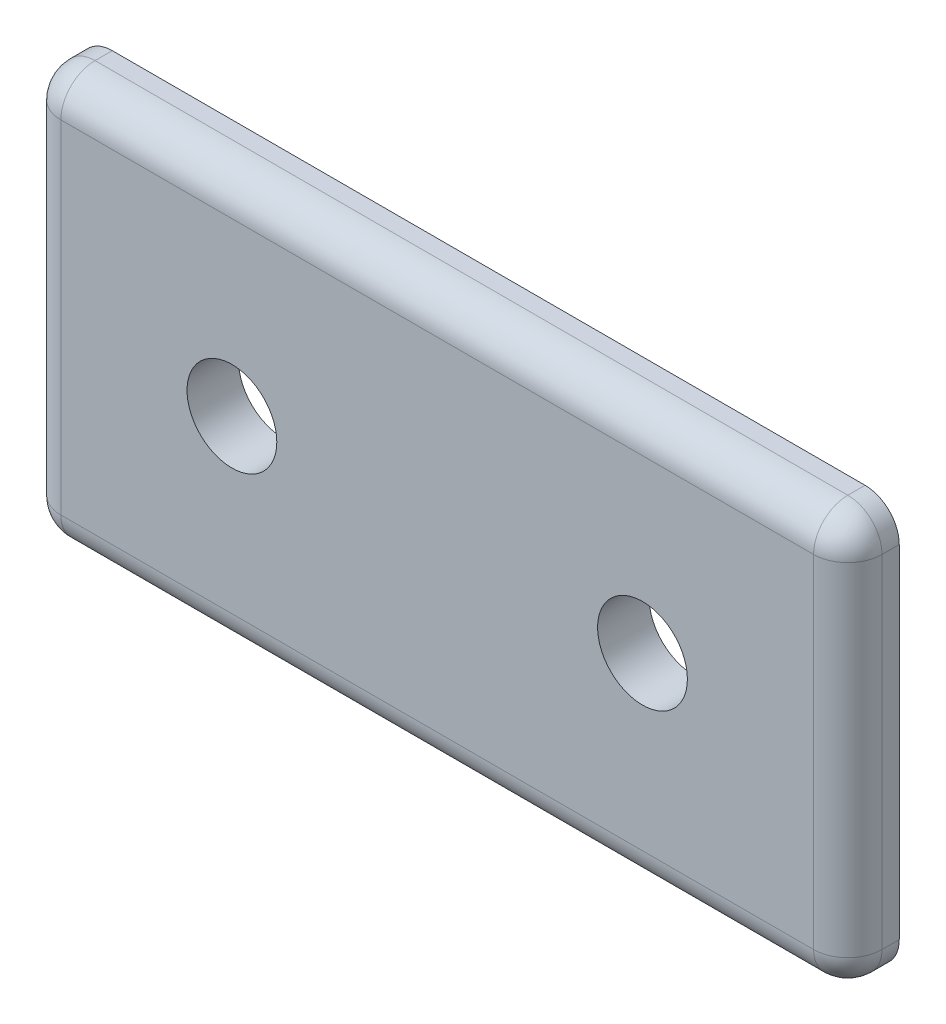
ISO-10303-21;
HEADER;
FILE_DESCRIPTION(('STEP AP214'),'2;1');
FILE_NAME('part.step','',(''),(''),'','','');
FILE_SCHEMA(('AUTOMOTIVE_DESIGN { 1 0 10303 214 1 1 1 1 }'));
ENDSEC;
DATA;
#1=APPLICATION_CONTEXT('core data for automotive mechanical design processes');
#2=APPLICATION_PROTOCOL_DEFINITION('international standard','automotive_design',2000,#1);
#3=PRODUCT_CONTEXT('',#1,'mechanical');
#4=PRODUCT('Part','Part','',(#3));
#5=PRODUCT_RELATED_PRODUCT_CATEGORY('part','',(#4));
#6=PRODUCT_DEFINITION_FORMATION('','',#4);
#7=PRODUCT_DEFINITION_CONTEXT('part definition',#1,'design');
#8=PRODUCT_DEFINITION('design','',#6,#7);
#9=PRODUCT_DEFINITION_SHAPE('','',#8);
#10=(LENGTH_UNIT() NAMED_UNIT(*) SI_UNIT(.MILLI.,.METRE.));
#11=(NAMED_UNIT(*) PLANE_ANGLE_UNIT() SI_UNIT($,.RADIAN.));
#12=(NAMED_UNIT(*) SI_UNIT($,.STERADIAN.) SOLID_ANGLE_UNIT());
#13=UNCERTAINTY_MEASURE_WITH_UNIT(LENGTH_MEASURE(1.E-05),#10,'distance_accuracy_value','');
#14=(GEOMETRIC_REPRESENTATION_CONTEXT(3) GLOBAL_UNCERTAINTY_ASSIGNED_CONTEXT((#13)) GLOBAL_UNIT_ASSIGNED_CONTEXT((#10,
#11,#12)) REPRESENTATION_CONTEXT('',''));
#15=CARTESIAN_POINT('',(0.,0.,0.));
#16=DIRECTION('',(0.,0.,1.));
#17=DIRECTION('',(1.,0.,0.));
#18=AXIS2_PLACEMENT_3D('',#15,#16,#17);
#19=CARTESIAN_POINT('',(-38.1,19.05,4.7752));
#20=DIRECTION('',(1.,0.,0.));
#21=DIRECTION('',(0.,0.,-1.));
#22=AXIS2_PLACEMENT_3D('',#19,#20,#21);
#23=PLANE('',#22);
#24=DIRECTION('',(0.,-1.,0.));
#25=VECTOR('',#24,1.);
#26=CARTESIAN_POINT('',(-38.1,19.05,0.));
#27=LINE('',#26,#25);
#28=CARTESIAN_POINT('',(-38.1,15.875,0.));
#29=VERTEX_POINT('',#28);
#30=CARTESIAN_POINT('',(-38.1,-15.875,0.));
#31=VERTEX_POINT('',#30);
#32=EDGE_CURVE('E198',#29,#31,#27,.T.);
#33=ORIENTED_EDGE('',*,*,#32,.T.);
#34=DIRECTION('',(0.,0.,-1.));
#35=VECTOR('',#34,1.);
#36=CARTESIAN_POINT('',(-38.1,-15.875,4.7752));
#37=LINE('',#36,#35);
#38=CARTESIAN_POINT('',(-38.1,-15.875,1.6002));
#39=VERTEX_POINT('',#38);
#40=EDGE_CURVE('E49',#31,#39,#37,.F.);
#41=ORIENTED_EDGE('',*,*,#40,.T.);
#42=DIRECTION('',(0.,-1.,0.));
#43=VECTOR('',#42,1.);
#44=CARTESIAN_POINT('',(-38.1,19.05,1.6002));
#45=LINE('',#44,#43);
#46=CARTESIAN_POINT('',(-38.1,15.875,1.6002));
#47=VERTEX_POINT('',#46);
#48=EDGE_CURVE('E54',#39,#47,#45,.F.);
#49=ORIENTED_EDGE('',*,*,#48,.T.);
#50=DIRECTION('',(0.,0.,-1.));
#51=VECTOR('',#50,1.);
#52=CARTESIAN_POINT('',(-38.1,15.875,4.7752));
#53=LINE('',#52,#51);
#54=EDGE_CURVE('E167',#47,#29,#53,.T.);
#55=ORIENTED_EDGE('',*,*,#54,.T.);
#56=EDGE_LOOP('',(#33,#41,#49,#55));
#57=FACE_BOUND('',#56,.T.);
#58=ADVANCED_FACE('F32',(#57),#23,.F.);
#59=CARTESIAN_POINT('',(-38.1,-19.05,4.7752));
#60=DIRECTION('',(0.,1.,0.));
#61=DIRECTION('',(0.,0.,1.));
#62=AXIS2_PLACEMENT_3D('',#59,#60,#61);
#63=PLANE('',#62);
#64=DIRECTION('',(1.,0.,0.));
#65=VECTOR('',#64,1.);
#66=CARTESIAN_POINT('',(-38.1,-19.05,1.6002));
#67=LINE('',#66,#65);
#68=CARTESIAN_POINT('',(34.925,-19.05,1.6002));
#69=VERTEX_POINT('',#68);
#70=CARTESIAN_POINT('',(-34.925,-19.05,1.6002));
#71=VERTEX_POINT('',#70);
#72=EDGE_CURVE('E163',#69,#71,#67,.F.);
#73=ORIENTED_EDGE('',*,*,#72,.T.);
#74=DIRECTION('',(0.,0.,-1.));
#75=VECTOR('',#74,1.);
#76=CARTESIAN_POINT('',(-34.925,-19.05,4.7752));
#77=LINE('',#76,#75);
#78=CARTESIAN_POINT('',(-34.925,-19.05,0.));
#79=VERTEX_POINT('',#78);
#80=EDGE_CURVE('E165',#71,#79,#77,.T.);
#81=ORIENTED_EDGE('',*,*,#80,.T.);
#82=DIRECTION('',(1.,0.,0.));
#83=VECTOR('',#82,1.);
#84=CARTESIAN_POINT('',(-38.1,-19.05,0.));
#85=LINE('',#84,#83);
#86=CARTESIAN_POINT('',(34.925,-19.05,0.));
#87=VERTEX_POINT('',#86);
#88=EDGE_CURVE('E200',#79,#87,#85,.T.);
#89=ORIENTED_EDGE('',*,*,#88,.T.);
#90=DIRECTION('',(0.,0.,-1.));
#91=VECTOR('',#90,1.);
#92=CARTESIAN_POINT('',(34.925,-19.05,4.7752));
#93=LINE('',#92,#91);
#94=EDGE_CURVE('E161',#87,#69,#93,.F.);
#95=ORIENTED_EDGE('',*,*,#94,.T.);
#96=EDGE_LOOP('',(#73,#81,#89,#95));
#97=FACE_BOUND('',#96,.T.);
#98=ADVANCED_FACE('F254',(#97),#63,.F.);
#99=CARTESIAN_POINT('',(38.1,19.05,4.7752));
#100=DIRECTION('',(-1.,0.,0.));
#101=DIRECTION('',(0.,0.,1.));
#102=AXIS2_PLACEMENT_3D('',#99,#100,#101);
#103=PLANE('',#102);
#104=DIRECTION('',(0.,1.,0.));
#105=VECTOR('',#104,1.);
#106=CARTESIAN_POINT('',(38.1,-19.05,1.6002));
#107=LINE('',#106,#105);
#108=CARTESIAN_POINT('',(38.1,15.875,1.6002));
#109=VERTEX_POINT('',#108);
#110=CARTESIAN_POINT('',(38.1,-15.875,1.6002));
#111=VERTEX_POINT('',#110);
#112=EDGE_CURVE('E157',#109,#111,#107,.F.);
#113=ORIENTED_EDGE('',*,*,#112,.T.);
#114=DIRECTION('',(0.,0.,-1.));
#115=VECTOR('',#114,1.);
#116=CARTESIAN_POINT('',(38.1,-15.875,4.7752));
#117=LINE('',#116,#115);
#118=CARTESIAN_POINT('',(38.1,-15.875,0.));
#119=VERTEX_POINT('',#118);
#120=EDGE_CURVE('E159',#111,#119,#117,.T.);
#121=ORIENTED_EDGE('',*,*,#120,.T.);
#122=DIRECTION('',(0.,1.,0.));
#123=VECTOR('',#122,1.);
#124=CARTESIAN_POINT('',(38.1,19.05,0.));
#125=LINE('',#124,#123);
#126=CARTESIAN_POINT('',(38.1,15.875,0.));
#127=VERTEX_POINT('',#126);
#128=EDGE_CURVE('E204',#119,#127,#125,.T.);
#129=ORIENTED_EDGE('',*,*,#128,.T.);
#130=DIRECTION('',(0.,0.,-1.));
#131=VECTOR('',#130,1.);
#132=CARTESIAN_POINT('',(38.1,15.875,4.7752));
#133=LINE('',#132,#131);
#134=EDGE_CURVE('E155',#127,#109,#133,.F.);
#135=ORIENTED_EDGE('',*,*,#134,.T.);
#136=EDGE_LOOP('',(#113,#121,#129,#135));
#137=FACE_BOUND('',#136,.T.);
#138=ADVANCED_FACE('F259',(#137),#103,.F.);
#139=CARTESIAN_POINT('',(-38.1,19.05,4.7752));
#140=DIRECTION('',(0.,-1.,0.));
#141=DIRECTION('',(0.,0.,-1.));
#142=AXIS2_PLACEMENT_3D('',#139,#140,#141);
#143=PLANE('',#142);
#144=DIRECTION('',(-1.,0.,0.));
#145=VECTOR('',#144,1.);
#146=CARTESIAN_POINT('',(38.1,19.05,1.6002));
#147=LINE('',#146,#145);
#148=CARTESIAN_POINT('',(-34.925,19.05,1.6002));
#149=VERTEX_POINT('',#148);
#150=CARTESIAN_POINT('',(34.925,19.05,1.6002));
#151=VERTEX_POINT('',#150);
#152=EDGE_CURVE('E117',#149,#151,#147,.F.);
#153=ORIENTED_EDGE('',*,*,#152,.T.);
#154=DIRECTION('',(0.,0.,-1.));
#155=VECTOR('',#154,1.);
#156=CARTESIAN_POINT('',(34.925,19.05,4.7752));
#157=LINE('',#156,#155);
#158=CARTESIAN_POINT('',(34.925,19.05,0.));
#159=VERTEX_POINT('',#158);
#160=EDGE_CURVE('E153',#151,#159,#157,.T.);
#161=ORIENTED_EDGE('',*,*,#160,.T.);
#162=DIRECTION('',(-1.,0.,0.));
#163=VECTOR('',#162,1.);
#164=CARTESIAN_POINT('',(-38.1,19.05,0.));
#165=LINE('',#164,#163);
#166=CARTESIAN_POINT('',(-34.925,19.05,0.));
#167=VERTEX_POINT('',#166);
#168=EDGE_CURVE('E140',#159,#167,#165,.T.);
#169=ORIENTED_EDGE('',*,*,#168,.T.);
#170=DIRECTION('',(0.,0.,-1.));
#171=VECTOR('',#170,1.);
#172=CARTESIAN_POINT('',(-34.925,19.05,4.7752));
#173=LINE('',#172,#171);
#174=EDGE_CURVE('E146',#167,#149,#173,.F.);
#175=ORIENTED_EDGE('',*,*,#174,.T.);
#176=EDGE_LOOP('',(#153,#161,#169,#175));
#177=FACE_BOUND('',#176,.T.);
#178=ADVANCED_FACE('F231',(#177),#143,.F.);
#179=CARTESIAN_POINT('',(-38.1,-19.05,4.7752));
#180=DIRECTION('',(0.,0.,1.));
#181=DIRECTION('',(1.,0.,0.));
#182=AXIS2_PLACEMENT_3D('',#179,#180,#181);
#183=PLANE('',#182);
#184=CARTESIAN_POINT('',(-19.05,0.,4.7752));
#185=DIRECTION('',(0.,0.,1.));
#186=DIRECTION('',(1.,0.,0.));
#187=AXIS2_PLACEMENT_3D('',#184,#185,#186);
#188=CIRCLE('',#187,4.1656);
#189=CARTESIAN_POINT('',(-14.8844,0.,4.7752));
#190=VERTEX_POINT('',#189);
#191=EDGE_CURVE('E421',#190,#190,#188,.T.);
#192=ORIENTED_EDGE('',*,*,#191,.F.);
#193=EDGE_LOOP('',(#192));
#194=FACE_BOUND('',#193,.T.);
#195=CARTESIAN_POINT('',(19.05,0.,4.7752));
#196=DIRECTION('',(0.,0.,1.));
#197=DIRECTION('',(1.,0.,0.));
#198=AXIS2_PLACEMENT_3D('',#195,#196,#197);
#199=CIRCLE('',#198,4.1656);
#200=CARTESIAN_POINT('',(23.2156,0.,4.7752));
#201=VERTEX_POINT('',#200);
#202=EDGE_CURVE('E424',#201,#201,#199,.T.);
#203=ORIENTED_EDGE('',*,*,#202,.F.);
#204=EDGE_LOOP('',(#203));
#205=FACE_BOUND('',#204,.T.);
#206=DIRECTION('',(0.,1.,0.));
#207=VECTOR('',#206,1.);
#208=CARTESIAN_POINT('',(34.925,19.05,4.7752));
#209=LINE('',#208,#207);
#210=CARTESIAN_POINT('',(34.925,-15.875,4.7752));
#211=VERTEX_POINT('',#210);
#212=CARTESIAN_POINT('',(34.925,15.875,4.7752));
#213=VERTEX_POINT('',#212);
#214=EDGE_CURVE('E144',#211,#213,#209,.T.);
#215=ORIENTED_EDGE('',*,*,#214,.T.);
#216=DIRECTION('',(-1.,0.,0.));
#217=VECTOR('',#216,1.);
#218=CARTESIAN_POINT('',(-38.1,15.875,4.7752));
#219=LINE('',#218,#217);
#220=CARTESIAN_POINT('',(-34.925,15.875,4.7752));
#221=VERTEX_POINT('',#220);
#222=EDGE_CURVE('E115',#213,#221,#219,.T.);
#223=ORIENTED_EDGE('',*,*,#222,.T.);
#224=DIRECTION('',(0.,-1.,0.));
#225=VECTOR('',#224,1.);
#226=CARTESIAN_POINT('',(-34.925,-19.05,4.7752));
#227=LINE('',#226,#225);
#228=CARTESIAN_POINT('',(-34.925,-15.875,4.7752));
#229=VERTEX_POINT('',#228);
#230=EDGE_CURVE('E133',#221,#229,#227,.T.);
#231=ORIENTED_EDGE('',*,*,#230,.T.);
#232=DIRECTION('',(1.,0.,0.));
#233=VECTOR('',#232,1.);
#234=CARTESIAN_POINT('',(38.1,-15.875,4.7752));
#235=LINE('',#234,#233);
#236=EDGE_CURVE('E139',#229,#211,#235,.T.);
#237=ORIENTED_EDGE('',*,*,#236,.T.);
#238=EDGE_LOOP('',(#215,#223,#231,#237));
#239=FACE_BOUND('',#238,.T.);
#240=ADVANCED_FACE('F142',(#194,#205,#239),#183,.T.);
#241=CARTESIAN_POINT('',(-38.1,-19.05,0.));
#242=DIRECTION('',(0.,0.,1.));
#243=DIRECTION('',(1.,0.,0.));
#244=AXIS2_PLACEMENT_3D('',#241,#242,#243);
#245=PLANE('',#244);
#246=CARTESIAN_POINT('',(-19.05,0.,0.));
#247=DIRECTION('',(0.,0.,1.));
#248=DIRECTION('',(1.,0.,0.));
#249=AXIS2_PLACEMENT_3D('',#246,#247,#248);
#250=CIRCLE('',#249,4.1656);
#251=CARTESIAN_POINT('',(-14.8844,0.,0.));
#252=VERTEX_POINT('',#251);
#253=EDGE_CURVE('E425',#252,#252,#250,.F.);
#254=ORIENTED_EDGE('',*,*,#253,.F.);
#255=EDGE_LOOP('',(#254));
#256=FACE_BOUND('',#255,.T.);
#257=CARTESIAN_POINT('',(19.05,0.,0.));
#258=DIRECTION('',(0.,0.,1.));
#259=DIRECTION('',(1.,0.,0.));
#260=AXIS2_PLACEMENT_3D('',#257,#258,#259);
#261=CIRCLE('',#260,4.1656);
#262=CARTESIAN_POINT('',(23.2156,0.,0.));
#263=VERTEX_POINT('',#262);
#264=EDGE_CURVE('E121',#263,#263,#261,.F.);
#265=ORIENTED_EDGE('',*,*,#264,.F.);
#266=EDGE_LOOP('',(#265));
#267=FACE_BOUND('',#266,.T.);
#268=ORIENTED_EDGE('',*,*,#88,.F.);
#269=CARTESIAN_POINT('',(-34.925,-15.875,0.));
#270=DIRECTION('',(0.,0.,1.));
#271=DIRECTION('',(1.,0.,0.));
#272=AXIS2_PLACEMENT_3D('',#269,#270,#271);
#273=CIRCLE('',#272,3.175);
#274=EDGE_CURVE('E11',#79,#31,#273,.F.);
#275=ORIENTED_EDGE('',*,*,#274,.T.);
#276=ORIENTED_EDGE('',*,*,#32,.F.);
#277=CARTESIAN_POINT('',(-34.925,15.875,0.));
#278=DIRECTION('',(0.,0.,1.));
#279=DIRECTION('',(1.,0.,0.));
#280=AXIS2_PLACEMENT_3D('',#277,#278,#279);
#281=CIRCLE('',#280,3.175);
#282=EDGE_CURVE('E171',#29,#167,#281,.F.);
#283=ORIENTED_EDGE('',*,*,#282,.T.);
#284=ORIENTED_EDGE('',*,*,#168,.F.);
#285=CARTESIAN_POINT('',(34.925,15.875,0.));
#286=DIRECTION('',(0.,0.,1.));
#287=DIRECTION('',(1.,0.,0.));
#288=AXIS2_PLACEMENT_3D('',#285,#286,#287);
#289=CIRCLE('',#288,3.175);
#290=EDGE_CURVE('E173',#159,#127,#289,.F.);
#291=ORIENTED_EDGE('',*,*,#290,.T.);
#292=ORIENTED_EDGE('',*,*,#128,.F.);
#293=CARTESIAN_POINT('',(34.925,-15.875,0.));
#294=DIRECTION('',(0.,0.,1.));
#295=DIRECTION('',(1.,0.,0.));
#296=AXIS2_PLACEMENT_3D('',#293,#294,#295);
#297=CIRCLE('',#296,3.175);
#298=EDGE_CURVE('E41',#119,#87,#297,.F.);
#299=ORIENTED_EDGE('',*,*,#298,.T.);
#300=EDGE_LOOP('',(#268,#275,#276,#283,#284,#291,#292,#299));
#301=FACE_BOUND('',#300,.T.);
#302=ADVANCED_FACE('F238',(#256,#267,#301),#245,.F.);
#303=CARTESIAN_POINT('',(34.925,-15.875,4.7752));
#304=DIRECTION('',(0.,0.,-1.));
#305=DIRECTION('',(-1.,0.,0.));
#306=AXIS2_PLACEMENT_3D('',#303,#304,#305);
#307=CYLINDRICAL_SURFACE('',#306,3.175);
#308=ORIENTED_EDGE('',*,*,#298,.F.);
#309=ORIENTED_EDGE('',*,*,#120,.F.);
#310=CARTESIAN_POINT('',(34.925,-15.875,1.6002));
#311=DIRECTION('',(0.,0.,1.));
#312=DIRECTION('',(1.,0.,0.));
#313=AXIS2_PLACEMENT_3D('',#310,#311,#312);
#314=CIRCLE('',#313,3.175);
#315=EDGE_CURVE('E36',#69,#111,#314,.T.);
#316=ORIENTED_EDGE('',*,*,#315,.F.);
#317=ORIENTED_EDGE('',*,*,#94,.F.);
#318=EDGE_LOOP('',(#308,#309,#316,#317));
#319=FACE_BOUND('',#318,.T.);
#320=ADVANCED_FACE('F34',(#319),#307,.T.);
#321=CARTESIAN_POINT('',(-38.1,-15.875,1.6002));
#322=DIRECTION('',(-1.,0.,0.));
#323=DIRECTION('',(0.,0.,1.));
#324=AXIS2_PLACEMENT_3D('',#321,#322,#323);
#325=CYLINDRICAL_SURFACE('',#324,3.175);
#326=CARTESIAN_POINT('',(-34.925,-15.875,1.6002));
#327=DIRECTION('',(-1.,0.,0.));
#328=DIRECTION('',(0.,0.,1.));
#329=AXIS2_PLACEMENT_3D('',#326,#327,#328);
#330=CIRCLE('',#329,3.175);
#331=EDGE_CURVE('E190',#71,#229,#330,.T.);
#332=ORIENTED_EDGE('',*,*,#331,.F.);
#333=ORIENTED_EDGE('',*,*,#72,.F.);
#334=CARTESIAN_POINT('',(34.925,-15.875,1.6002));
#335=DIRECTION('',(1.,0.,0.));
#336=DIRECTION('',(0.,0.,-1.));
#337=AXIS2_PLACEMENT_3D('',#334,#335,#336);
#338=CIRCLE('',#337,3.175);
#339=EDGE_CURVE('E192',#211,#69,#338,.T.);
#340=ORIENTED_EDGE('',*,*,#339,.F.);
#341=ORIENTED_EDGE('',*,*,#236,.F.);
#342=EDGE_LOOP('',(#332,#333,#340,#341));
#343=FACE_BOUND('',#342,.T.);
#344=ADVANCED_FACE('F215',(#343),#325,.T.);
#345=CARTESIAN_POINT('',(-34.925,-15.875,4.7752));
#346=DIRECTION('',(0.,0.,-1.));
#347=DIRECTION('',(-1.,0.,0.));
#348=AXIS2_PLACEMENT_3D('',#345,#346,#347);
#349=CYLINDRICAL_SURFACE('',#348,3.175);
#350=ORIENTED_EDGE('',*,*,#274,.F.);
#351=ORIENTED_EDGE('',*,*,#80,.F.);
#352=CARTESIAN_POINT('',(-34.925,-15.875,1.6002));
#353=DIRECTION('',(0.,0.,1.));
#354=DIRECTION('',(1.,0.,0.));
#355=AXIS2_PLACEMENT_3D('',#352,#353,#354);
#356=CIRCLE('',#355,3.175);
#357=EDGE_CURVE('E187',#39,#71,#356,.T.);
#358=ORIENTED_EDGE('',*,*,#357,.F.);
#359=ORIENTED_EDGE('',*,*,#40,.F.);
#360=EDGE_LOOP('',(#350,#351,#358,#359));
#361=FACE_BOUND('',#360,.T.);
#362=ADVANCED_FACE('F242',(#361),#349,.T.);
#363=CARTESIAN_POINT('',(34.925,-15.875,1.6002));
#364=DIRECTION('',(0.,0.,1.));
#365=DIRECTION('',(1.,0.,0.));
#366=AXIS2_PLACEMENT_3D('',#363,#364,#365);
#367=SPHERICAL_SURFACE('',#366,3.175);
#368=ORIENTED_EDGE('',*,*,#339,.T.);
#369=ORIENTED_EDGE('',*,*,#315,.T.);
#370=CARTESIAN_POINT('',(34.925,-15.875,1.6002));
#371=DIRECTION('',(0.,-1.,0.));
#372=DIRECTION('',(0.,0.,-1.));
#373=AXIS2_PLACEMENT_3D('',#370,#371,#372);
#374=CIRCLE('',#373,3.175);
#375=EDGE_CURVE('E184',#211,#111,#374,.F.);
#376=ORIENTED_EDGE('',*,*,#375,.F.);
#377=EDGE_LOOP('',(#368,#369,#376));
#378=FACE_BOUND('',#377,.T.);
#379=ADVANCED_FACE('F216',(#378),#367,.T.);
#380=CARTESIAN_POINT('',(-34.925,-15.875,1.6002));
#381=DIRECTION('',(0.,0.,1.));
#382=DIRECTION('',(1.,0.,0.));
#383=AXIS2_PLACEMENT_3D('',#380,#381,#382);
#384=SPHERICAL_SURFACE('',#383,3.175);
#385=ORIENTED_EDGE('',*,*,#357,.T.);
#386=ORIENTED_EDGE('',*,*,#331,.T.);
#387=CARTESIAN_POINT('',(-34.925,-15.875,1.6002));
#388=DIRECTION('',(0.,-1.,0.));
#389=DIRECTION('',(0.,0.,-1.));
#390=AXIS2_PLACEMENT_3D('',#387,#388,#389);
#391=CIRCLE('',#390,3.175);
#392=EDGE_CURVE('E136',#39,#229,#391,.F.);
#393=ORIENTED_EDGE('',*,*,#392,.F.);
#394=EDGE_LOOP('',(#385,#386,#393));
#395=FACE_BOUND('',#394,.T.);
#396=ADVANCED_FACE('F244',(#395),#384,.T.);
#397=CARTESIAN_POINT('',(34.925,15.875,4.7752));
#398=DIRECTION('',(0.,0.,-1.));
#399=DIRECTION('',(-1.,0.,0.));
#400=AXIS2_PLACEMENT_3D('',#397,#398,#399);
#401=CYLINDRICAL_SURFACE('',#400,3.175);
#402=ORIENTED_EDGE('',*,*,#290,.F.);
#403=ORIENTED_EDGE('',*,*,#160,.F.);
#404=CARTESIAN_POINT('',(34.925,15.875,1.6002));
#405=DIRECTION('',(0.,0.,1.));
#406=DIRECTION('',(1.,0.,0.));
#407=AXIS2_PLACEMENT_3D('',#404,#405,#406);
#408=CIRCLE('',#407,3.175);
#409=EDGE_CURVE('E180',#109,#151,#408,.T.);
#410=ORIENTED_EDGE('',*,*,#409,.F.);
#411=ORIENTED_EDGE('',*,*,#134,.F.);
#412=EDGE_LOOP('',(#402,#403,#410,#411));
#413=FACE_BOUND('',#412,.T.);
#414=ADVANCED_FACE('F228',(#413),#401,.T.);
#415=CARTESIAN_POINT('',(34.925,-19.05,1.6002));
#416=DIRECTION('',(0.,-1.,0.));
#417=DIRECTION('',(0.,0.,-1.));
#418=AXIS2_PLACEMENT_3D('',#415,#416,#417);
#419=CYLINDRICAL_SURFACE('',#418,3.175);
#420=ORIENTED_EDGE('',*,*,#375,.T.);
#421=ORIENTED_EDGE('',*,*,#112,.F.);
#422=CARTESIAN_POINT('',(34.925,15.875,1.6002));
#423=DIRECTION('',(0.,1.,0.));
#424=DIRECTION('',(-1.,0.,0.));
#425=AXIS2_PLACEMENT_3D('',#422,#423,#424);
#426=CIRCLE('',#425,3.175);
#427=EDGE_CURVE('E130',#213,#109,#426,.T.);
#428=ORIENTED_EDGE('',*,*,#427,.F.);
#429=ORIENTED_EDGE('',*,*,#214,.F.);
#430=EDGE_LOOP('',(#420,#421,#428,#429));
#431=FACE_BOUND('',#430,.T.);
#432=ADVANCED_FACE('F219',(#431),#419,.T.);
#433=CARTESIAN_POINT('',(-34.925,-19.05,1.6002));
#434=DIRECTION('',(0.,1.,0.));
#435=DIRECTION('',(0.,0.,1.));
#436=AXIS2_PLACEMENT_3D('',#433,#434,#435);
#437=CYLINDRICAL_SURFACE('',#436,3.175);
#438=ORIENTED_EDGE('',*,*,#392,.T.);
#439=ORIENTED_EDGE('',*,*,#230,.F.);
#440=CARTESIAN_POINT('',(-34.925,15.875,1.6002));
#441=DIRECTION('',(0.,1.,0.));
#442=DIRECTION('',(0.,0.,1.));
#443=AXIS2_PLACEMENT_3D('',#440,#441,#442);
#444=CIRCLE('',#443,3.175);
#445=EDGE_CURVE('E124',#47,#221,#444,.T.);
#446=ORIENTED_EDGE('',*,*,#445,.F.);
#447=ORIENTED_EDGE('',*,*,#48,.F.);
#448=EDGE_LOOP('',(#438,#439,#446,#447));
#449=FACE_BOUND('',#448,.T.);
#450=ADVANCED_FACE('F134',(#449),#437,.T.);
#451=CARTESIAN_POINT('',(-34.925,15.875,4.7752));
#452=DIRECTION('',(0.,0.,-1.));
#453=DIRECTION('',(-1.,0.,0.));
#454=AXIS2_PLACEMENT_3D('',#451,#452,#453);
#455=CYLINDRICAL_SURFACE('',#454,3.175);
#456=ORIENTED_EDGE('',*,*,#282,.F.);
#457=ORIENTED_EDGE('',*,*,#54,.F.);
#458=CARTESIAN_POINT('',(-34.925,15.875,1.6002));
#459=DIRECTION('',(0.,0.,1.));
#460=DIRECTION('',(1.,0.,0.));
#461=AXIS2_PLACEMENT_3D('',#458,#459,#460);
#462=CIRCLE('',#461,3.175);
#463=EDGE_CURVE('E128',#149,#47,#462,.T.);
#464=ORIENTED_EDGE('',*,*,#463,.F.);
#465=ORIENTED_EDGE('',*,*,#174,.F.);
#466=EDGE_LOOP('',(#456,#457,#464,#465));
#467=FACE_BOUND('',#466,.T.);
#468=ADVANCED_FACE('F235',(#467),#455,.T.);
#469=CARTESIAN_POINT('',(34.925,15.875,1.6002));
#470=DIRECTION('',(0.,0.,1.));
#471=DIRECTION('',(1.,0.,0.));
#472=AXIS2_PLACEMENT_3D('',#469,#470,#471);
#473=SPHERICAL_SURFACE('',#472,3.175);
#474=ORIENTED_EDGE('',*,*,#427,.T.);
#475=ORIENTED_EDGE('',*,*,#409,.T.);
#476=CARTESIAN_POINT('',(34.925,15.875,1.6002));
#477=DIRECTION('',(1.,0.,0.));
#478=DIRECTION('',(0.,0.,-1.));
#479=AXIS2_PLACEMENT_3D('',#476,#477,#478);
#480=CIRCLE('',#479,3.175);
#481=EDGE_CURVE('E120',#213,#151,#480,.F.);
#482=ORIENTED_EDGE('',*,*,#481,.F.);
#483=EDGE_LOOP('',(#474,#475,#482));
#484=FACE_BOUND('',#483,.T.);
#485=ADVANCED_FACE('F223',(#484),#473,.T.);
#486=CARTESIAN_POINT('',(-34.925,15.875,1.6002));
#487=DIRECTION('',(0.,0.,1.));
#488=DIRECTION('',(1.,0.,0.));
#489=AXIS2_PLACEMENT_3D('',#486,#487,#488);
#490=SPHERICAL_SURFACE('',#489,3.175);
#491=ORIENTED_EDGE('',*,*,#463,.T.);
#492=ORIENTED_EDGE('',*,*,#445,.T.);
#493=CARTESIAN_POINT('',(-34.925,15.875,1.6002));
#494=DIRECTION('',(-1.,0.,0.));
#495=DIRECTION('',(0.,0.,1.));
#496=AXIS2_PLACEMENT_3D('',#493,#494,#495);
#497=CIRCLE('',#496,3.175);
#498=EDGE_CURVE('E111',#149,#221,#497,.F.);
#499=ORIENTED_EDGE('',*,*,#498,.F.);
#500=EDGE_LOOP('',(#491,#492,#499));
#501=FACE_BOUND('',#500,.T.);
#502=ADVANCED_FACE('F126',(#501),#490,.T.);
#503=CARTESIAN_POINT('',(-38.1,15.875,1.6002));
#504=DIRECTION('',(1.,0.,0.));
#505=DIRECTION('',(0.,0.,-1.));
#506=AXIS2_PLACEMENT_3D('',#503,#504,#505);
#507=CYLINDRICAL_SURFACE('',#506,3.175);
#508=ORIENTED_EDGE('',*,*,#481,.T.);
#509=ORIENTED_EDGE('',*,*,#152,.F.);
#510=ORIENTED_EDGE('',*,*,#498,.T.);
#511=ORIENTED_EDGE('',*,*,#222,.F.);
#512=EDGE_LOOP('',(#508,#509,#510,#511));
#513=FACE_BOUND('',#512,.T.);
#514=ADVANCED_FACE('F113',(#513),#507,.T.);
#515=CARTESIAN_POINT('',(19.05,0.,-0.00100000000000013));
#516=DIRECTION('',(0.,0.,1.));
#517=DIRECTION('',(1.,0.,0.));
#518=AXIS2_PLACEMENT_3D('',#515,#516,#517);
#519=CYLINDRICAL_SURFACE('',#518,4.1656);
#520=CARTESIAN_POINT('',(23.2156,0.,4.7752));
#521=CARTESIAN_POINT('',(23.2156,0.,4.72545833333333));
#522=CARTESIAN_POINT('',(23.2156,0.,4.67571666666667));
#523=CARTESIAN_POINT('',(23.2156,0.,4.57623333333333));
#524=CARTESIAN_POINT('',(23.2156,0.,4.52649166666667));
#525=CARTESIAN_POINT('',(23.2156,0.,4.42700833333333));
#526=CARTESIAN_POINT('',(23.2156,0.,4.37726666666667));
#527=CARTESIAN_POINT('',(23.2156,0.,4.27778333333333));
#528=CARTESIAN_POINT('',(23.2156,0.,4.22804166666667));
#529=CARTESIAN_POINT('',(23.2156,0.,4.12855833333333));
#530=CARTESIAN_POINT('',(23.2156,0.,4.07881666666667));
#531=CARTESIAN_POINT('',(23.2156,0.,3.97933333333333));
#532=CARTESIAN_POINT('',(23.2156,0.,3.92959166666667));
#533=CARTESIAN_POINT('',(23.2156,0.,3.83010833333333));
#534=CARTESIAN_POINT('',(23.2156,0.,3.78036666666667));
#535=CARTESIAN_POINT('',(23.2156,0.,3.68088333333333));
#536=CARTESIAN_POINT('',(23.2156,0.,3.63114166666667));
#537=CARTESIAN_POINT('',(23.2156,0.,3.53165833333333));
#538=CARTESIAN_POINT('',(23.2156,0.,3.48191666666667));
#539=CARTESIAN_POINT('',(23.2156,0.,3.38243333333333));
#540=CARTESIAN_POINT('',(23.2156,0.,3.33269166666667));
#541=CARTESIAN_POINT('',(23.2156,0.,3.23320833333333));
#542=CARTESIAN_POINT('',(23.2156,0.,3.18346666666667));
#543=CARTESIAN_POINT('',(23.2156,0.,3.08398333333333));
#544=CARTESIAN_POINT('',(23.2156,0.,3.03424166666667));
#545=CARTESIAN_POINT('',(23.2156,0.,2.93475833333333));
#546=CARTESIAN_POINT('',(23.2156,0.,2.88501666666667));
#547=CARTESIAN_POINT('',(23.2156,0.,2.78553333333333));
#548=CARTESIAN_POINT('',(23.2156,0.,2.73579166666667));
#549=CARTESIAN_POINT('',(23.2156,0.,2.63630833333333));
#550=CARTESIAN_POINT('',(23.2156,0.,2.58656666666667));
#551=CARTESIAN_POINT('',(23.2156,0.,2.48708333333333));
#552=CARTESIAN_POINT('',(23.2156,0.,2.43734166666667));
#553=CARTESIAN_POINT('',(23.2156,0.,2.33785833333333));
#554=CARTESIAN_POINT('',(23.2156,0.,2.28811666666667));
#555=CARTESIAN_POINT('',(23.2156,0.,2.18863333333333));
#556=CARTESIAN_POINT('',(23.2156,0.,2.13889166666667));
#557=CARTESIAN_POINT('',(23.2156,0.,2.03940833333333));
#558=CARTESIAN_POINT('',(23.2156,0.,1.98966666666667));
#559=CARTESIAN_POINT('',(23.2156,0.,1.89018333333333));
#560=CARTESIAN_POINT('',(23.2156,0.,1.84044166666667));
#561=CARTESIAN_POINT('',(23.2156,0.,1.74095833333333));
#562=CARTESIAN_POINT('',(23.2156,0.,1.69121666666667));
#563=CARTESIAN_POINT('',(23.2156,0.,1.59173333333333));
#564=CARTESIAN_POINT('',(23.2156,0.,1.54199166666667));
#565=CARTESIAN_POINT('',(23.2156,0.,1.44250833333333));
#566=CARTESIAN_POINT('',(23.2156,0.,1.39276666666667));
#567=CARTESIAN_POINT('',(23.2156,0.,1.29328333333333));
#568=CARTESIAN_POINT('',(23.2156,0.,1.24354166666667));
#569=CARTESIAN_POINT('',(23.2156,0.,1.14405833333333));
#570=CARTESIAN_POINT('',(23.2156,0.,1.09431666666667));
#571=CARTESIAN_POINT('',(23.2156,0.,0.994833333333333));
#572=CARTESIAN_POINT('',(23.2156,0.,0.945091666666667));
#573=CARTESIAN_POINT('',(23.2156,0.,0.845608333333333));
#574=CARTESIAN_POINT('',(23.2156,0.,0.795866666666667));
#575=CARTESIAN_POINT('',(23.2156,0.,0.696383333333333));
#576=CARTESIAN_POINT('',(23.2156,0.,0.646641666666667));
#577=CARTESIAN_POINT('',(23.2156,0.,0.547158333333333));
#578=CARTESIAN_POINT('',(23.2156,0.,0.497416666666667));
#579=CARTESIAN_POINT('',(23.2156,0.,0.397933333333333));
#580=CARTESIAN_POINT('',(23.2156,0.,0.348191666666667));
#581=CARTESIAN_POINT('',(23.2156,0.,0.248708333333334));
#582=CARTESIAN_POINT('',(23.2156,0.,0.198966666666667));
#583=CARTESIAN_POINT('',(23.2156,0.,0.0994833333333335));
#584=CARTESIAN_POINT('',(23.2156,0.,0.0497416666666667));
#585=CARTESIAN_POINT('',(23.2156,0.,0.));
#586=B_SPLINE_CURVE_WITH_KNOTS('',3,(#520,#521,#522,#523,#524,#525,#526,#527,#528,#529,#530,
#531,#532,#533,#534,#535,#536,#537,#538,#539,#540,#541,#542,#543,#544,#545,#546,#547,#548,#549,
#550,#551,#552,#553,#554,#555,#556,#557,#558,#559,#560,#561,#562,#563,#564,#565,#566,#567,#568,
#569,#570,#571,#572,#573,#574,#575,#576,#577,#578,#579,#580,#581,#582,#583,#584,#585),
.UNSPECIFIED.,.F.,.F.,(4,2,2,2,2,2,2,2,2,2,2,2,2,2,2,2,2,2,2,2,2,2,2,2,2,2,2,2,2,2,2,2,4),(0.,
0.149225,0.29845,0.447675,0.5969,0.746125,0.89535,1.044575,1.1938,1.343025,1.49225,1.641475,
1.7907,1.939925,2.08915,2.238375,2.3876,2.536825,2.68605,2.835275,2.9845,3.133725,3.28295,
3.432175,3.5814,3.730625,3.87985,4.029075,4.1783,4.327525,4.47675,4.625975,4.7752),.UNSPECIFIED.);
#587=EDGE_CURVE('BSEAM266',#201,#263,#586,.T.);
#588=ORIENTED_EDGE('',*,*,#202,.T.);
#589=ORIENTED_EDGE('',*,*,#264,.T.);
#590=ORIENTED_EDGE('',*,*,#587,.T.);
#591=ORIENTED_EDGE('',*,*,#587,.F.);
#592=EDGE_LOOP('',(#588,#590,#589,#591));
#593=FACE_BOUND('',#592,.T.);
#594=ADVANCED_FACE('F266',(#593),#519,.F.);
#595=CARTESIAN_POINT('',(-19.05,0.,-0.00100000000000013));
#596=DIRECTION('',(0.,0.,1.));
#597=DIRECTION('',(1.,0.,0.));
#598=AXIS2_PLACEMENT_3D('',#595,#596,#597);
#599=CYLINDRICAL_SURFACE('',#598,4.1656);
#600=CARTESIAN_POINT('',(-14.8844,0.,4.7752));
#601=CARTESIAN_POINT('',(-14.8844,0.,4.72545833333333));
#602=CARTESIAN_POINT('',(-14.8844,0.,4.67571666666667));
#603=CARTESIAN_POINT('',(-14.8844,0.,4.57623333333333));
#604=CARTESIAN_POINT('',(-14.8844,0.,4.52649166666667));
#605=CARTESIAN_POINT('',(-14.8844,0.,4.42700833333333));
#606=CARTESIAN_POINT('',(-14.8844,0.,4.37726666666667));
#607=CARTESIAN_POINT('',(-14.8844,0.,4.27778333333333));
#608=CARTESIAN_POINT('',(-14.8844,0.,4.22804166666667));
#609=CARTESIAN_POINT('',(-14.8844,0.,4.12855833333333));
#610=CARTESIAN_POINT('',(-14.8844,0.,4.07881666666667));
#611=CARTESIAN_POINT('',(-14.8844,0.,3.97933333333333));
#612=CARTESIAN_POINT('',(-14.8844,0.,3.92959166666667));
#613=CARTESIAN_POINT('',(-14.8844,0.,3.83010833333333));
#614=CARTESIAN_POINT('',(-14.8844,0.,3.78036666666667));
#615=CARTESIAN_POINT('',(-14.8844,0.,3.68088333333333));
#616=CARTESIAN_POINT('',(-14.8844,0.,3.63114166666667));
#617=CARTESIAN_POINT('',(-14.8844,0.,3.53165833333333));
#618=CARTESIAN_POINT('',(-14.8844,0.,3.48191666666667));
#619=CARTESIAN_POINT('',(-14.8844,0.,3.38243333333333));
#620=CARTESIAN_POINT('',(-14.8844,0.,3.33269166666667));
#621=CARTESIAN_POINT('',(-14.8844,0.,3.23320833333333));
#622=CARTESIAN_POINT('',(-14.8844,0.,3.18346666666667));
#623=CARTESIAN_POINT('',(-14.8844,0.,3.08398333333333));
#624=CARTESIAN_POINT('',(-14.8844,0.,3.03424166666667));
#625=CARTESIAN_POINT('',(-14.8844,0.,2.93475833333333));
#626=CARTESIAN_POINT('',(-14.8844,0.,2.88501666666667));
#627=CARTESIAN_POINT('',(-14.8844,0.,2.78553333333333));
#628=CARTESIAN_POINT('',(-14.8844,0.,2.73579166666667));
#629=CARTESIAN_POINT('',(-14.8844,0.,2.63630833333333));
#630=CARTESIAN_POINT('',(-14.8844,0.,2.58656666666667));
#631=CARTESIAN_POINT('',(-14.8844,0.,2.48708333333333));
#632=CARTESIAN_POINT('',(-14.8844,0.,2.43734166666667));
#633=CARTESIAN_POINT('',(-14.8844,0.,2.33785833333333));
#634=CARTESIAN_POINT('',(-14.8844,0.,2.28811666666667));
#635=CARTESIAN_POINT('',(-14.8844,0.,2.18863333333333));
#636=CARTESIAN_POINT('',(-14.8844,0.,2.13889166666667));
#637=CARTESIAN_POINT('',(-14.8844,0.,2.03940833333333));
#638=CARTESIAN_POINT('',(-14.8844,0.,1.98966666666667));
#639=CARTESIAN_POINT('',(-14.8844,0.,1.89018333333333));
#640=CARTESIAN_POINT('',(-14.8844,0.,1.84044166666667));
#641=CARTESIAN_POINT('',(-14.8844,0.,1.74095833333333));
#642=CARTESIAN_POINT('',(-14.8844,0.,1.69121666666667));
#643=CARTESIAN_POINT('',(-14.8844,0.,1.59173333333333));
#644=CARTESIAN_POINT('',(-14.8844,0.,1.54199166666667));
#645=CARTESIAN_POINT('',(-14.8844,0.,1.44250833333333));
#646=CARTESIAN_POINT('',(-14.8844,0.,1.39276666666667));
#647=CARTESIAN_POINT('',(-14.8844,0.,1.29328333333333));
#648=CARTESIAN_POINT('',(-14.8844,0.,1.24354166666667));
#649=CARTESIAN_POINT('',(-14.8844,0.,1.14405833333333));
#650=CARTESIAN_POINT('',(-14.8844,0.,1.09431666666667));
#651=CARTESIAN_POINT('',(-14.8844,0.,0.994833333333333));
#652=CARTESIAN_POINT('',(-14.8844,0.,0.945091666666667));
#653=CARTESIAN_POINT('',(-14.8844,0.,0.845608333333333));
#654=CARTESIAN_POINT('',(-14.8844,0.,0.795866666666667));
#655=CARTESIAN_POINT('',(-14.8844,0.,0.696383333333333));
#656=CARTESIAN_POINT('',(-14.8844,0.,0.646641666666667));
#657=CARTESIAN_POINT('',(-14.8844,0.,0.547158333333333));
#658=CARTESIAN_POINT('',(-14.8844,0.,0.497416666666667));
#659=CARTESIAN_POINT('',(-14.8844,0.,0.397933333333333));
#660=CARTESIAN_POINT('',(-14.8844,0.,0.348191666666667));
#661=CARTESIAN_POINT('',(-14.8844,0.,0.248708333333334));
#662=CARTESIAN_POINT('',(-14.8844,0.,0.198966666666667));
#663=CARTESIAN_POINT('',(-14.8844,0.,0.0994833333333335));
#664=CARTESIAN_POINT('',(-14.8844,0.,0.0497416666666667));
#665=CARTESIAN_POINT('',(-14.8844,0.,0.));
#666=B_SPLINE_CURVE_WITH_KNOTS('',3,(#600,#601,#602,#603,#604,#605,#606,#607,#608,#609,#610,
#611,#612,#613,#614,#615,#616,#617,#618,#619,#620,#621,#622,#623,#624,#625,#626,#627,#628,#629,
#630,#631,#632,#633,#634,#635,#636,#637,#638,#639,#640,#641,#642,#643,#644,#645,#646,#647,#648,
#649,#650,#651,#652,#653,#654,#655,#656,#657,#658,#659,#660,#661,#662,#663,#664,#665),
.UNSPECIFIED.,.F.,.F.,(4,2,2,2,2,2,2,2,2,2,2,2,2,2,2,2,2,2,2,2,2,2,2,2,2,2,2,2,2,2,2,2,4),(0.,
0.149225,0.29845,0.447675,0.5969,0.746125,0.89535,1.044575,1.1938,1.343025,1.49225,1.641475,
1.7907,1.939925,2.08915,2.238375,2.3876,2.536825,2.68605,2.835275,2.9845,3.133725,3.28295,
3.432175,3.5814,3.730625,3.87985,4.029075,4.1783,4.327525,4.47675,4.625975,4.7752),.UNSPECIFIED.);
#667=EDGE_CURVE('BSEAM307',#190,#252,#666,.T.);
#668=ORIENTED_EDGE('',*,*,#191,.T.);
#669=ORIENTED_EDGE('',*,*,#253,.T.);
#670=ORIENTED_EDGE('',*,*,#667,.T.);
#671=ORIENTED_EDGE('',*,*,#667,.F.);
#672=EDGE_LOOP('',(#668,#670,#669,#671));
#673=FACE_BOUND('',#672,.T.);
#674=ADVANCED_FACE('F307',(#673),#599,.F.);
#675=CLOSED_SHELL('',(#58,#98,#138,#178,#240,#302,#320,#344,#362,#379,#396,#414,#432,#450,#468,
#485,#502,#514,#594,#674));
#676=MANIFOLD_SOLID_BREP('B2',#675);
#677=ADVANCED_BREP_SHAPE_REPRESENTATION('',(#18,#676),#14);
#678=SHAPE_DEFINITION_REPRESENTATION(#9,#677);
ENDSEC;
END-ISO-10303-21;
